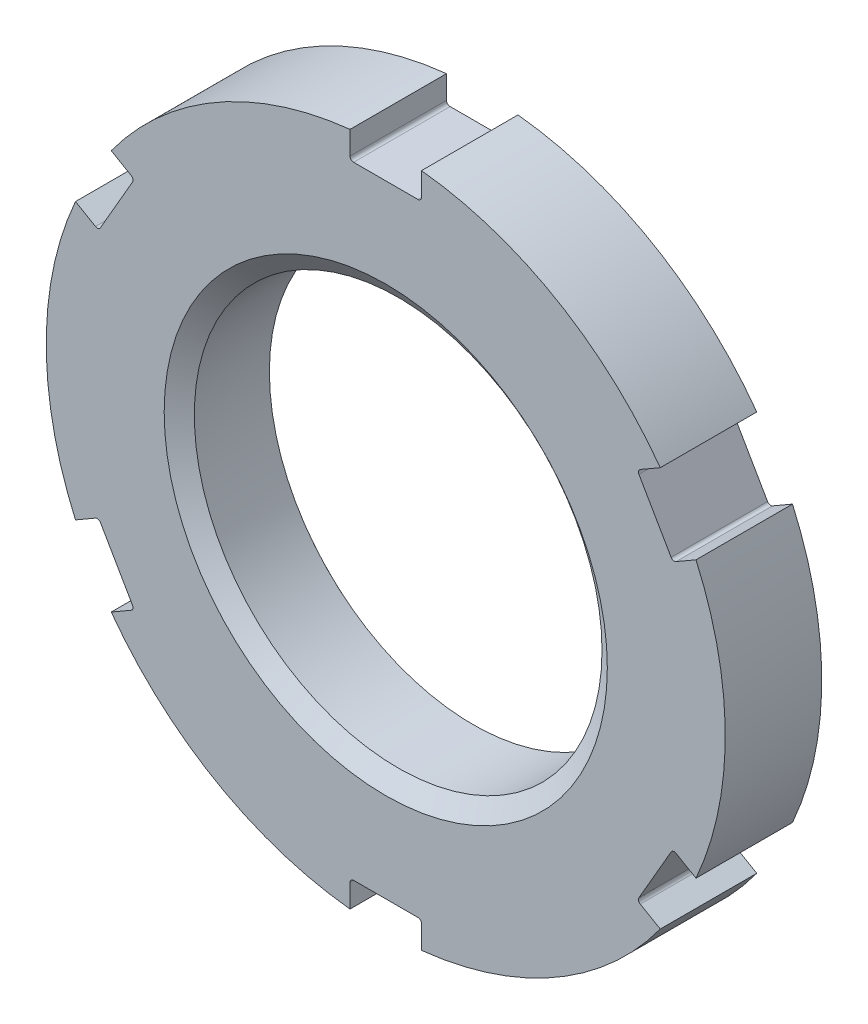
ISO-10303-21;
HEADER;
FILE_DESCRIPTION(('STEP AP214'),'2;1');
FILE_NAME('part.step','',(''),(''),'','','');
FILE_SCHEMA(('AUTOMOTIVE_DESIGN { 1 0 10303 214 1 1 1 1 }'));
ENDSEC;
DATA;
#1=APPLICATION_CONTEXT('core data for automotive mechanical design processes');
#2=APPLICATION_PROTOCOL_DEFINITION('international standard','automotive_design',2000,#1);
#3=PRODUCT_CONTEXT('',#1,'mechanical');
#4=PRODUCT('Part','Part','',(#3));
#5=PRODUCT_RELATED_PRODUCT_CATEGORY('part','',(#4));
#6=PRODUCT_DEFINITION_FORMATION('','',#4);
#7=PRODUCT_DEFINITION_CONTEXT('part definition',#1,'design');
#8=PRODUCT_DEFINITION('design','',#6,#7);
#9=PRODUCT_DEFINITION_SHAPE('','',#8);
#10=(LENGTH_UNIT() NAMED_UNIT(*) SI_UNIT(.MILLI.,.METRE.));
#11=(NAMED_UNIT(*) PLANE_ANGLE_UNIT() SI_UNIT($,.RADIAN.));
#12=(NAMED_UNIT(*) SI_UNIT($,.STERADIAN.) SOLID_ANGLE_UNIT());
#13=UNCERTAINTY_MEASURE_WITH_UNIT(LENGTH_MEASURE(1.E-05),#10,'distance_accuracy_value','');
#14=(GEOMETRIC_REPRESENTATION_CONTEXT(3) GLOBAL_UNCERTAINTY_ASSIGNED_CONTEXT((#13)) GLOBAL_UNIT_ASSIGNED_CONTEXT((#10,
#11,#12)) REPRESENTATION_CONTEXT('',''));
#15=CARTESIAN_POINT('',(0.,0.,0.));
#16=DIRECTION('',(0.,0.,1.));
#17=DIRECTION('',(1.,0.,0.));
#18=AXIS2_PLACEMENT_3D('',#15,#16,#17);
#19=CARTESIAN_POINT('',(0.,0.,-14.));
#20=DIRECTION('',(0.,0.,1.));
#21=DIRECTION('',(1.,0.,0.));
#22=AXIS2_PLACEMENT_3D('',#19,#20,#21);
#23=CYLINDRICAL_SURFACE('',#22,47.5);
#24=DIRECTION('',(0.,0.,1.));
#25=VECTOR('',#24,1.);
#26=CARTESIAN_POINT('',(38.4076704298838,27.9481815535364,-14.));
#27=LINE('',#26,#25);
#28=CARTESIAN_POINT('',(38.4076704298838,27.9481815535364,-13.5));
#29=VERTEX_POINT('',#28);
#30=CARTESIAN_POINT('',(38.4076704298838,27.9481815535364,0.));
#31=VERTEX_POINT('',#30);
#32=EDGE_CURVE('E282',#29,#31,#27,.T.);
#33=ORIENTED_EDGE('',*,*,#32,.F.);
#34=CARTESIAN_POINT('',(0.,0.,-13.5));
#35=DIRECTION('',(0.,0.,-1.));
#36=DIRECTION('',(-1.,0.,0.));
#37=AXIS2_PLACEMENT_3D('',#34,#35,#36);
#38=CIRCLE('',#37,47.5);
#39=CARTESIAN_POINT('',(4.99999999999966,47.236109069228,-13.5));
#40=VERTEX_POINT('',#39);
#41=EDGE_CURVE('E542',#29,#40,#38,.F.);
#42=ORIENTED_EDGE('',*,*,#41,.T.);
#43=DIRECTION('',(0.,0.,1.));
#44=VECTOR('',#43,1.);
#45=CARTESIAN_POINT('',(4.99999999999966,47.236109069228,-14.));
#46=LINE('',#45,#44);
#47=CARTESIAN_POINT('',(4.99999999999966,47.236109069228,0.));
#48=VERTEX_POINT('',#47);
#49=EDGE_CURVE('E379',#48,#40,#46,.F.);
#50=ORIENTED_EDGE('',*,*,#49,.F.);
#51=CARTESIAN_POINT('',(0.,0.,0.));
#52=DIRECTION('',(0.,0.,1.));
#53=DIRECTION('',(1.,0.,0.));
#54=AXIS2_PLACEMENT_3D('',#51,#52,#53);
#55=CIRCLE('',#54,47.5);
#56=EDGE_CURVE('E545',#31,#48,#55,.T.);
#57=ORIENTED_EDGE('',*,*,#56,.F.);
#58=EDGE_LOOP('',(#33,#42,#50,#57));
#59=FACE_BOUND('',#58,.T.);
#60=ADVANCED_FACE('F36',(#59),#23,.T.);
#61=DIRECTION('',(0.,0.,1.));
#62=VECTOR('',#61,1.);
#63=CARTESIAN_POINT('',(-5.00000000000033,47.2361090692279,-14.));
#64=LINE('',#63,#62);
#65=CARTESIAN_POINT('',(-5.00000000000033,47.2361090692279,-13.5));
#66=VERTEX_POINT('',#65);
#67=CARTESIAN_POINT('',(-5.00000000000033,47.2361090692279,0.));
#68=VERTEX_POINT('',#67);
#69=EDGE_CURVE('E377',#66,#68,#64,.T.);
#70=ORIENTED_EDGE('',*,*,#69,.F.);
#71=CARTESIAN_POINT('',(-38.4076704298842,27.9481815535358,-13.5));
#72=VERTEX_POINT('',#71);
#73=EDGE_CURVE('E575',#66,#72,#38,.F.);
#74=ORIENTED_EDGE('',*,*,#73,.T.);
#75=DIRECTION('',(0.,0.,1.));
#76=VECTOR('',#75,1.);
#77=CARTESIAN_POINT('',(-38.4076704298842,27.9481815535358,-14.));
#78=LINE('',#77,#76);
#79=CARTESIAN_POINT('',(-38.4076704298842,27.9481815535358,0.));
#80=VERTEX_POINT('',#79);
#81=EDGE_CURVE('E375',#80,#72,#78,.F.);
#82=ORIENTED_EDGE('',*,*,#81,.F.);
#83=EDGE_CURVE('E547',#68,#80,#55,.T.);
#84=ORIENTED_EDGE('',*,*,#83,.F.);
#85=EDGE_LOOP('',(#70,#74,#82,#84));
#86=FACE_BOUND('',#85,.T.);
#87=ADVANCED_FACE('F650',(#86),#23,.T.);
#88=DIRECTION('',(0.,0.,1.));
#89=VECTOR('',#88,1.);
#90=CARTESIAN_POINT('',(-43.4076704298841,19.2879275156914,-14.));
#91=LINE('',#90,#89);
#92=CARTESIAN_POINT('',(-43.4076704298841,19.2879275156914,-13.5));
#93=VERTEX_POINT('',#92);
#94=CARTESIAN_POINT('',(-43.4076704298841,19.2879275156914,0.));
#95=VERTEX_POINT('',#94);
#96=EDGE_CURVE('E373',#93,#95,#91,.T.);
#97=ORIENTED_EDGE('',*,*,#96,.F.);
#98=CARTESIAN_POINT('',(-43.4076704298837,-19.2879275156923,-13.5));
#99=VERTEX_POINT('',#98);
#100=EDGE_CURVE('E573',#93,#99,#38,.F.);
#101=ORIENTED_EDGE('',*,*,#100,.T.);
#102=DIRECTION('',(0.,0.,1.));
#103=VECTOR('',#102,1.);
#104=CARTESIAN_POINT('',(-43.4076704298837,-19.2879275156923,-14.));
#105=LINE('',#104,#103);
#106=CARTESIAN_POINT('',(-43.4076704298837,-19.2879275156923,0.));
#107=VERTEX_POINT('',#106);
#108=EDGE_CURVE('E371',#107,#99,#105,.F.);
#109=ORIENTED_EDGE('',*,*,#108,.F.);
#110=EDGE_CURVE('E550',#95,#107,#55,.T.);
#111=ORIENTED_EDGE('',*,*,#110,.F.);
#112=EDGE_LOOP('',(#97,#101,#109,#111));
#113=FACE_BOUND('',#112,.T.);
#114=ADVANCED_FACE('F654',(#113),#23,.T.);
#115=DIRECTION('',(0.,0.,1.));
#116=VECTOR('',#115,1.);
#117=CARTESIAN_POINT('',(-38.4076704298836,-27.9481815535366,-14.));
#118=LINE('',#117,#116);
#119=CARTESIAN_POINT('',(-38.4076704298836,-27.9481815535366,-13.5));
#120=VERTEX_POINT('',#119);
#121=CARTESIAN_POINT('',(-38.4076704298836,-27.9481815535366,0.));
#122=VERTEX_POINT('',#121);
#123=EDGE_CURVE('E302',#120,#122,#118,.T.);
#124=ORIENTED_EDGE('',*,*,#123,.F.);
#125=CARTESIAN_POINT('',(-4.99999999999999,-47.236109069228,-13.5));
#126=VERTEX_POINT('',#125);
#127=EDGE_CURVE('E442',#120,#126,#38,.F.);
#128=ORIENTED_EDGE('',*,*,#127,.T.);
#129=DIRECTION('',(0.,0.,1.));
#130=VECTOR('',#129,1.);
#131=CARTESIAN_POINT('',(-4.99999999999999,-47.236109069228,-14.));
#132=LINE('',#131,#130);
#133=CARTESIAN_POINT('',(-4.99999999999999,-47.236109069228,0.));
#134=VERTEX_POINT('',#133);
#135=EDGE_CURVE('E435',#134,#126,#132,.F.);
#136=ORIENTED_EDGE('',*,*,#135,.F.);
#137=EDGE_CURVE('E460',#122,#134,#55,.T.);
#138=ORIENTED_EDGE('',*,*,#137,.F.);
#139=EDGE_LOOP('',(#124,#128,#136,#138));
#140=FACE_BOUND('',#139,.T.);
#141=ADVANCED_FACE('F570',(#140),#23,.T.);
#142=DIRECTION('',(0.,0.,1.));
#143=VECTOR('',#142,1.);
#144=CARTESIAN_POINT('',(43.4076704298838,19.287927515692,-14.));
#145=LINE('',#144,#143);
#146=CARTESIAN_POINT('',(43.4076704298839,19.287927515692,0.));
#147=VERTEX_POINT('',#146);
#148=CARTESIAN_POINT('',(43.4076704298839,19.287927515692,-13.5));
#149=VERTEX_POINT('',#148);
#150=EDGE_CURVE('E382',#147,#149,#145,.F.);
#151=ORIENTED_EDGE('',*,*,#150,.F.);
#152=CARTESIAN_POINT('',(43.407670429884,-19.2879275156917,0.));
#153=VERTEX_POINT('',#152);
#154=EDGE_CURVE('E459',#153,#147,#55,.T.);
#155=ORIENTED_EDGE('',*,*,#154,.F.);
#156=DIRECTION('',(0.,0.,1.));
#157=VECTOR('',#156,1.);
#158=CARTESIAN_POINT('',(43.407670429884,-19.2879275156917,-14.));
#159=LINE('',#158,#157);
#160=CARTESIAN_POINT('',(43.407670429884,-19.2879275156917,-13.5));
#161=VERTEX_POINT('',#160);
#162=EDGE_CURVE('E401',#161,#153,#159,.T.);
#163=ORIENTED_EDGE('',*,*,#162,.F.);
#164=EDGE_CURVE('E469',#161,#149,#38,.F.);
#165=ORIENTED_EDGE('',*,*,#164,.T.);
#166=EDGE_LOOP('',(#151,#155,#163,#165));
#167=FACE_BOUND('',#166,.T.);
#168=ADVANCED_FACE('F590',(#167),#23,.T.);
#169=DIRECTION('',(0.,0.,1.));
#170=VECTOR('',#169,1.);
#171=CARTESIAN_POINT('',(38.407670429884,-27.9481815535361,-14.));
#172=LINE('',#171,#170);
#173=CARTESIAN_POINT('',(38.407670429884,-27.9481815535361,0.));
#174=VERTEX_POINT('',#173);
#175=CARTESIAN_POINT('',(38.407670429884,-27.9481815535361,-13.5));
#176=VERTEX_POINT('',#175);
#177=EDGE_CURVE('E408',#174,#176,#172,.F.);
#178=ORIENTED_EDGE('',*,*,#177,.F.);
#179=CARTESIAN_POINT('',(5.,-47.236109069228,0.));
#180=VERTEX_POINT('',#179);
#181=EDGE_CURVE('E455',#180,#174,#55,.T.);
#182=ORIENTED_EDGE('',*,*,#181,.F.);
#183=DIRECTION('',(0.,0.,1.));
#184=VECTOR('',#183,1.);
#185=CARTESIAN_POINT('',(5.,-47.236109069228,-14.));
#186=LINE('',#185,#184);
#187=CARTESIAN_POINT('',(5.,-47.236109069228,-13.5));
#188=VERTEX_POINT('',#187);
#189=EDGE_CURVE('E428',#188,#180,#186,.T.);
#190=ORIENTED_EDGE('',*,*,#189,.F.);
#191=EDGE_CURVE('E449',#188,#176,#38,.F.);
#192=ORIENTED_EDGE('',*,*,#191,.T.);
#193=EDGE_LOOP('',(#178,#182,#190,#192));
#194=FACE_BOUND('',#193,.T.);
#195=ADVANCED_FACE('F38',(#194),#23,.T.);
#196=CARTESIAN_POINT('',(0.,0.,-14.));
#197=DIRECTION('',(0.,0.,1.));
#198=DIRECTION('',(1.,0.,0.));
#199=AXIS2_PLACEMENT_3D('',#196,#197,#198);
#200=PLANE('',#199);
#201=CARTESIAN_POINT('',(0.,0.,-14.));
#202=DIRECTION('',(0.,0.,1.));
#203=DIRECTION('',(1.,0.,0.));
#204=AXIS2_PLACEMENT_3D('',#201,#202,#203);
#205=CIRCLE('',#204,31.);
#206=CARTESIAN_POINT('',(31.,0.,-14.));
#207=VERTEX_POINT('',#206);
#208=EDGE_CURVE('E448',#207,#207,#205,.F.);
#209=ORIENTED_EDGE('',*,*,#208,.F.);
#210=EDGE_LOOP('',(#209));
#211=FACE_BOUND('',#210,.T.);
#212=CARTESIAN_POINT('',(0.,0.,-14.));
#213=DIRECTION('',(0.,0.,-1.));
#214=DIRECTION('',(-1.,0.,0.));
#215=AXIS2_PLACEMENT_3D('',#212,#213,#214);
#216=CIRCLE('',#215,41.2749999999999);
#217=CARTESIAN_POINT('',(-41.2749999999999,0.,-14.));
#218=VERTEX_POINT('',#217);
#219=EDGE_CURVE('E438',#218,#218,#216,.T.);
#220=ORIENTED_EDGE('',*,*,#219,.T.);
#221=EDGE_LOOP('',(#220));
#222=FACE_BOUND('',#221,.T.);
#223=ADVANCED_FACE('F656',(#211,#222),#200,.F.);
#224=CARTESIAN_POINT('',(0.,0.,-14.));
#225=DIRECTION('',(0.,0.,1.));
#226=DIRECTION('',(1.,0.,0.));
#227=AXIS2_PLACEMENT_3D('',#224,#225,#226);
#228=CYLINDRICAL_SURFACE('',#227,28.52);
#229=CARTESIAN_POINT('',(0.,0.,-1.73651469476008));
#230=DIRECTION('',(0.,0.,1.));
#231=DIRECTION('',(1.,0.,0.));
#232=AXIS2_PLACEMENT_3D('',#229,#230,#231);
#233=CIRCLE('',#232,28.52);
#234=CARTESIAN_POINT('',(28.52,0.,-1.73651469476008));
#235=VERTEX_POINT('',#234);
#236=EDGE_CURVE('E453',#235,#235,#233,.F.);
#237=ORIENTED_EDGE('',*,*,#236,.F.);
#238=EDGE_LOOP('',(#237));
#239=FACE_BOUND('',#238,.T.);
#240=CARTESIAN_POINT('',(0.,0.,-12.2380853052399));
#241=DIRECTION('',(0.,0.,-1.));
#242=DIRECTION('',(-1.,0.,0.));
#243=AXIS2_PLACEMENT_3D('',#240,#241,#242);
#244=CIRCLE('',#243,28.52);
#245=CARTESIAN_POINT('',(-28.52,0.,-12.2380853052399));
#246=VERTEX_POINT('',#245);
#247=EDGE_CURVE('E454',#246,#246,#244,.F.);
#248=ORIENTED_EDGE('',*,*,#247,.F.);
#249=EDGE_LOOP('',(#248));
#250=FACE_BOUND('',#249,.T.);
#251=ADVANCED_FACE('F661',(#239,#250),#228,.F.);
#252=CARTESIAN_POINT('',(0.,0.,0.));
#253=DIRECTION('',(0.,0.,1.));
#254=DIRECTION('',(1.,0.,0.));
#255=AXIS2_PLACEMENT_3D('',#252,#253,#254);
#256=PLANE('',#255);
#257=DIRECTION('',(0.866025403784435,0.500000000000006,0.));
#258=VECTOR('',#257,1.);
#259=CARTESIAN_POINT('',(40.6051177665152,17.669872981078,0.));
#260=LINE('',#259,#258);
#261=CARTESIAN_POINT('',(40.6051177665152,17.669872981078,0.));
#262=VERTEX_POINT('',#261);
#263=EDGE_CURVE('E286',#262,#147,#260,.T.);
#264=ORIENTED_EDGE('',*,*,#263,.F.);
#265=CARTESIAN_POINT('',(40.3551177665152,18.1028856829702,0.));
#266=DIRECTION('',(0.,0.,1.));
#267=DIRECTION('',(0.500000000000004,-0.866025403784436,0.));
#268=AXIS2_PLACEMENT_3D('',#265,#266,#267);
#269=CIRCLE('',#268,0.5);
#270=CARTESIAN_POINT('',(39.922105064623,17.8528856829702,0.));
#271=VERTEX_POINT('',#270);
#272=EDGE_CURVE('E276',#271,#262,#269,.T.);
#273=ORIENTED_EDGE('',*,*,#272,.F.);
#274=DIRECTION('',(0.500000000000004,-0.866025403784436,0.));
#275=VECTOR('',#274,1.);
#276=CARTESIAN_POINT('',(35.422105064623,25.6471143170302,0.));
#277=LINE('',#276,#275);
#278=CARTESIAN_POINT('',(35.422105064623,25.6471143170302,0.));
#279=VERTEX_POINT('',#278);
#280=EDGE_CURVE('E293',#279,#271,#277,.T.);
#281=ORIENTED_EDGE('',*,*,#280,.F.);
#282=CARTESIAN_POINT('',(35.8551177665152,25.8971143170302,0.));
#283=DIRECTION('',(0.,0.,1.));
#284=DIRECTION('',(-0.500000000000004,0.866025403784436,0.));
#285=AXIS2_PLACEMENT_3D('',#282,#283,#284);
#286=CIRCLE('',#285,0.5);
#287=CARTESIAN_POINT('',(35.6051177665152,26.3301270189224,0.));
#288=VERTEX_POINT('',#287);
#289=EDGE_CURVE('E270',#288,#279,#286,.T.);
#290=ORIENTED_EDGE('',*,*,#289,.F.);
#291=DIRECTION('',(-0.866025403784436,-0.500000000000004,0.));
#292=VECTOR('',#291,1.);
#293=CARTESIAN_POINT('',(38.6362066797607,28.0801270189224,0.));
#294=LINE('',#293,#292);
#295=EDGE_CURVE('E279',#31,#288,#294,.T.);
#296=ORIENTED_EDGE('',*,*,#295,.F.);
#297=ORIENTED_EDGE('',*,*,#56,.T.);
#298=DIRECTION('',(0.,1.,0.));
#299=VECTOR('',#298,1.);
#300=CARTESIAN_POINT('',(4.99999999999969,44.,0.));
#301=LINE('',#300,#299);
#302=CARTESIAN_POINT('',(4.99999999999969,44.,0.));
#303=VERTEX_POINT('',#302);
#304=EDGE_CURVE('E306',#303,#48,#301,.T.);
#305=ORIENTED_EDGE('',*,*,#304,.F.);
#306=CARTESIAN_POINT('',(4.49999999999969,44.,0.));
#307=DIRECTION('',(0.,0.,1.));
#308=DIRECTION('',(1.,0.,0.));
#309=AXIS2_PLACEMENT_3D('',#306,#307,#308);
#310=CIRCLE('',#309,0.5);
#311=CARTESIAN_POINT('',(4.4999999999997,43.5,0.));
#312=VERTEX_POINT('',#311);
#313=EDGE_CURVE('E317',#312,#303,#310,.T.);
#314=ORIENTED_EDGE('',*,*,#313,.F.);
#315=DIRECTION('',(1.,0.,0.));
#316=VECTOR('',#315,1.);
#317=CARTESIAN_POINT('',(-4.5000000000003,43.5,0.));
#318=LINE('',#317,#316);
#319=CARTESIAN_POINT('',(-4.5000000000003,43.5,0.));
#320=VERTEX_POINT('',#319);
#321=EDGE_CURVE('E314',#320,#312,#318,.T.);
#322=ORIENTED_EDGE('',*,*,#321,.F.);
#323=CARTESIAN_POINT('',(-4.50000000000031,44.,0.));
#324=DIRECTION('',(0.,0.,1.));
#325=DIRECTION('',(-1.,0.,0.));
#326=AXIS2_PLACEMENT_3D('',#323,#324,#325);
#327=CIRCLE('',#326,0.5);
#328=CARTESIAN_POINT('',(-5.00000000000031,44.,0.));
#329=VERTEX_POINT('',#328);
#330=EDGE_CURVE('E311',#329,#320,#327,.T.);
#331=ORIENTED_EDGE('',*,*,#330,.F.);
#332=DIRECTION('',(0.,-1.,0.));
#333=VECTOR('',#332,1.);
#334=CARTESIAN_POINT('',(-5.00000000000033,47.5,0.));
#335=LINE('',#334,#333);
#336=EDGE_CURVE('E308',#68,#329,#335,.T.);
#337=ORIENTED_EDGE('',*,*,#336,.F.);
#338=ORIENTED_EDGE('',*,*,#83,.T.);
#339=DIRECTION('',(-0.866025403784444,0.49999999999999,0.));
#340=VECTOR('',#339,1.);
#341=CARTESIAN_POINT('',(-35.6051177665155,26.3301270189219,0.));
#342=LINE('',#341,#340);
#343=CARTESIAN_POINT('',(-35.6051177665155,26.3301270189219,0.));
#344=VERTEX_POINT('',#343);
#345=EDGE_CURVE('E327',#344,#80,#342,.T.);
#346=ORIENTED_EDGE('',*,*,#345,.F.);
#347=CARTESIAN_POINT('',(-35.8551177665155,25.8971143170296,0.));
#348=DIRECTION('',(0.,0.,1.));
#349=DIRECTION('',(0.499999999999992,0.866025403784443,0.));
#350=AXIS2_PLACEMENT_3D('',#347,#348,#349);
#351=CIRCLE('',#350,0.5);
#352=CARTESIAN_POINT('',(-35.4221050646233,25.6471143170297,0.));
#353=VERTEX_POINT('',#352);
#354=EDGE_CURVE('E339',#353,#344,#351,.T.);
#355=ORIENTED_EDGE('',*,*,#354,.F.);
#356=DIRECTION('',(0.499999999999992,0.866025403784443,0.));
#357=VECTOR('',#356,1.);
#358=CARTESIAN_POINT('',(-39.9221050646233,17.8528856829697,0.));
#359=LINE('',#358,#357);
#360=CARTESIAN_POINT('',(-39.9221050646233,17.8528856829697,0.));
#361=VERTEX_POINT('',#360);
#362=EDGE_CURVE('E336',#361,#353,#359,.T.);
#363=ORIENTED_EDGE('',*,*,#362,.F.);
#364=CARTESIAN_POINT('',(-40.3551177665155,18.1028856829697,0.));
#365=DIRECTION('',(0.,0.,1.));
#366=DIRECTION('',(-0.499999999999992,-0.866025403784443,0.));
#367=AXIS2_PLACEMENT_3D('',#364,#365,#366);
#368=CIRCLE('',#367,0.5);
#369=CARTESIAN_POINT('',(-40.6051177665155,17.6698729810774,0.));
#370=VERTEX_POINT('',#369);
#371=EDGE_CURVE('E333',#370,#361,#368,.T.);
#372=ORIENTED_EDGE('',*,*,#371,.F.);
#373=DIRECTION('',(0.866025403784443,-0.499999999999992,0.));
#374=VECTOR('',#373,1.);
#375=CARTESIAN_POINT('',(-43.636206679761,19.4198729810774,0.));
#376=LINE('',#375,#374);
#377=EDGE_CURVE('E329',#95,#370,#376,.T.);
#378=ORIENTED_EDGE('',*,*,#377,.F.);
#379=ORIENTED_EDGE('',*,*,#110,.T.);
#380=DIRECTION('',(-0.866025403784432,-0.500000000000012,0.));
#381=VECTOR('',#380,1.);
#382=CARTESIAN_POINT('',(-40.6051177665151,-17.6698729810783,0.));
#383=LINE('',#382,#381);
#384=CARTESIAN_POINT('',(-40.6051177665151,-17.6698729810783,0.));
#385=VERTEX_POINT('',#384);
#386=EDGE_CURVE('E349',#385,#107,#383,.T.);
#387=ORIENTED_EDGE('',*,*,#386,.F.);
#388=CARTESIAN_POINT('',(-40.3551177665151,-18.1028856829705,0.));
#389=DIRECTION('',(0.,0.,1.));
#390=DIRECTION('',(-0.50000000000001,0.866025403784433,0.));
#391=AXIS2_PLACEMENT_3D('',#388,#389,#390);
#392=CIRCLE('',#391,0.5);
#393=CARTESIAN_POINT('',(-39.9221050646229,-17.8528856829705,0.));
#394=VERTEX_POINT('',#393);
#395=EDGE_CURVE('E360',#394,#385,#392,.T.);
#396=ORIENTED_EDGE('',*,*,#395,.F.);
#397=DIRECTION('',(-0.50000000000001,0.866025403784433,0.));
#398=VECTOR('',#397,1.);
#399=CARTESIAN_POINT('',(-35.4221050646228,-25.6471143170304,0.));
#400=LINE('',#399,#398);
#401=CARTESIAN_POINT('',(-35.4221050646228,-25.6471143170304,0.));
#402=VERTEX_POINT('',#401);
#403=EDGE_CURVE('E357',#402,#394,#400,.T.);
#404=ORIENTED_EDGE('',*,*,#403,.F.);
#405=CARTESIAN_POINT('',(-35.855117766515,-25.8971143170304,0.));
#406=DIRECTION('',(0.,0.,1.));
#407=DIRECTION('',(0.50000000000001,-0.866025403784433,0.));
#408=AXIS2_PLACEMENT_3D('',#405,#406,#407);
#409=CIRCLE('',#408,0.5);
#410=CARTESIAN_POINT('',(-35.605117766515,-26.3301270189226,0.));
#411=VERTEX_POINT('',#410);
#412=EDGE_CURVE('E354',#411,#402,#409,.T.);
#413=ORIENTED_EDGE('',*,*,#412,.F.);
#414=DIRECTION('',(0.866025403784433,0.50000000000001,0.));
#415=VECTOR('',#414,1.);
#416=CARTESIAN_POINT('',(-38.6362066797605,-28.0801270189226,0.));
#417=LINE('',#416,#415);
#418=EDGE_CURVE('E351',#122,#411,#417,.T.);
#419=ORIENTED_EDGE('',*,*,#418,.F.);
#420=ORIENTED_EDGE('',*,*,#137,.T.);
#421=DIRECTION('',(0.,-1.,0.));
#422=VECTOR('',#421,1.);
#423=CARTESIAN_POINT('',(-5.,-44.,0.));
#424=LINE('',#423,#422);
#425=CARTESIAN_POINT('',(-5.,-44.,0.));
#426=VERTEX_POINT('',#425);
#427=EDGE_CURVE('E410',#426,#134,#424,.T.);
#428=ORIENTED_EDGE('',*,*,#427,.F.);
#429=CARTESIAN_POINT('',(-4.5,-44.,0.));
#430=DIRECTION('',(0.,0.,1.));
#431=DIRECTION('',(-1.,0.,0.));
#432=AXIS2_PLACEMENT_3D('',#429,#430,#431);
#433=CIRCLE('',#432,0.5);
#434=CARTESIAN_POINT('',(-4.5,-43.5,0.));
#435=VERTEX_POINT('',#434);
#436=EDGE_CURVE('E422',#435,#426,#433,.T.);
#437=ORIENTED_EDGE('',*,*,#436,.F.);
#438=DIRECTION('',(-1.,0.,0.));
#439=VECTOR('',#438,1.);
#440=CARTESIAN_POINT('',(4.5,-43.5,0.));
#441=LINE('',#440,#439);
#442=CARTESIAN_POINT('',(4.5,-43.5,0.));
#443=VERTEX_POINT('',#442);
#444=EDGE_CURVE('E419',#443,#435,#441,.T.);
#445=ORIENTED_EDGE('',*,*,#444,.F.);
#446=CARTESIAN_POINT('',(4.5,-44.,0.));
#447=DIRECTION('',(0.,0.,1.));
#448=DIRECTION('',(1.,0.,0.));
#449=AXIS2_PLACEMENT_3D('',#446,#447,#448);
#450=CIRCLE('',#449,0.5);
#451=CARTESIAN_POINT('',(5.,-44.,0.));
#452=VERTEX_POINT('',#451);
#453=EDGE_CURVE('E416',#452,#443,#450,.T.);
#454=ORIENTED_EDGE('',*,*,#453,.F.);
#455=DIRECTION('',(0.,1.,0.));
#456=VECTOR('',#455,1.);
#457=CARTESIAN_POINT('',(5.,-47.5,0.));
#458=LINE('',#457,#456);
#459=EDGE_CURVE('E413',#180,#452,#458,.T.);
#460=ORIENTED_EDGE('',*,*,#459,.F.);
#461=ORIENTED_EDGE('',*,*,#181,.T.);
#462=DIRECTION('',(0.866025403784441,-0.499999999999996,0.));
#463=VECTOR('',#462,1.);
#464=CARTESIAN_POINT('',(35.6051177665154,-26.3301270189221,0.));
#465=LINE('',#464,#463);
#466=CARTESIAN_POINT('',(35.6051177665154,-26.3301270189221,0.));
#467=VERTEX_POINT('',#466);
#468=EDGE_CURVE('E384',#467,#174,#465,.T.);
#469=ORIENTED_EDGE('',*,*,#468,.F.);
#470=CARTESIAN_POINT('',(35.8551177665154,-25.8971143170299,0.));
#471=DIRECTION('',(0.,0.,1.));
#472=DIRECTION('',(-0.499999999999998,-0.86602540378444,0.));
#473=AXIS2_PLACEMENT_3D('',#470,#471,#472);
#474=CIRCLE('',#473,0.5);
#475=CARTESIAN_POINT('',(35.4221050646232,-25.6471143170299,0.));
#476=VERTEX_POINT('',#475);
#477=EDGE_CURVE('E395',#476,#467,#474,.T.);
#478=ORIENTED_EDGE('',*,*,#477,.F.);
#479=DIRECTION('',(-0.499999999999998,-0.86602540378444,0.));
#480=VECTOR('',#479,1.);
#481=CARTESIAN_POINT('',(39.9221050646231,-17.8528856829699,0.));
#482=LINE('',#481,#480);
#483=CARTESIAN_POINT('',(39.9221050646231,-17.8528856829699,0.));
#484=VERTEX_POINT('',#483);
#485=EDGE_CURVE('E392',#484,#476,#482,.T.);
#486=ORIENTED_EDGE('',*,*,#485,.F.);
#487=CARTESIAN_POINT('',(40.3551177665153,-18.1028856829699,0.));
#488=DIRECTION('',(0.,0.,1.));
#489=DIRECTION('',(0.499999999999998,0.86602540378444,0.));
#490=AXIS2_PLACEMENT_3D('',#487,#488,#489);
#491=CIRCLE('',#490,0.5);
#492=CARTESIAN_POINT('',(40.6051177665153,-17.6698729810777,0.));
#493=VERTEX_POINT('',#492);
#494=EDGE_CURVE('E389',#493,#484,#491,.T.);
#495=ORIENTED_EDGE('',*,*,#494,.F.);
#496=DIRECTION('',(-0.86602540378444,0.499999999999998,0.));
#497=VECTOR('',#496,1.);
#498=CARTESIAN_POINT('',(43.6362066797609,-19.4198729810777,0.));
#499=LINE('',#498,#497);
#500=EDGE_CURVE('E386',#153,#493,#499,.T.);
#501=ORIENTED_EDGE('',*,*,#500,.F.);
#502=ORIENTED_EDGE('',*,*,#154,.T.);
#503=EDGE_LOOP('',(#264,#273,#281,#290,#296,#297,#305,#314,#322,#331,#337,#338,#346,#355,#363,
#372,#378,#379,#387,#396,#404,#413,#419,#420,#428,#437,#445,#454,#460,#461,#469,#478,#486,#495,
#501,#502));
#504=FACE_BOUND('',#503,.T.);
#505=CARTESIAN_POINT('',(0.,0.,0.));
#506=DIRECTION('',(0.,0.,1.));
#507=DIRECTION('',(1.,0.,0.));
#508=AXIS2_PLACEMENT_3D('',#505,#506,#507);
#509=CIRCLE('',#508,31.);
#510=CARTESIAN_POINT('',(31.,0.,0.));
#511=VERTEX_POINT('',#510);
#512=EDGE_CURVE('E450',#511,#511,#509,.T.);
#513=ORIENTED_EDGE('',*,*,#512,.F.);
#514=EDGE_LOOP('',(#513));
#515=FACE_BOUND('',#514,.T.);
#516=ADVANCED_FACE('F289',(#504,#515),#256,.T.);
#517=CARTESIAN_POINT('',(0.,0.,-1.91016616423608));
#518=DIRECTION('',(0.,0.,1.));
#519=DIRECTION('',(1.,0.,0.));
#520=AXIS2_PLACEMENT_3D('',#517,#518,#519);
#521=CONICAL_SURFACE('',#520,28.272,0.95993108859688);
#522=ORIENTED_EDGE('',*,*,#512,.T.);
#523=EDGE_LOOP('',(#522));
#524=FACE_BOUND('',#523,.T.);
#525=ORIENTED_EDGE('',*,*,#236,.T.);
#526=EDGE_LOOP('',(#525));
#527=FACE_BOUND('',#526,.T.);
#528=ADVANCED_FACE('F735',(#524,#527),#521,.F.);
#529=CARTESIAN_POINT('',(0.,0.,-13.9746));
#530=DIRECTION('',(0.,0.,-1.));
#531=DIRECTION('',(-1.,0.,0.));
#532=AXIS2_PLACEMENT_3D('',#529,#530,#531);
#533=CONICAL_SURFACE('',#532,31.,0.95993108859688);
#534=CARTESIAN_POINT('',(0.,0.,-13.9746));
#535=DIRECTION('',(0.,0.,1.));
#536=DIRECTION('',(1.,0.,0.));
#537=AXIS2_PLACEMENT_3D('',#534,#535,#536);
#538=CIRCLE('',#537,31.);
#539=CARTESIAN_POINT('',(31.,0.,-13.9746));
#540=VERTEX_POINT('',#539);
#541=EDGE_CURVE('E445',#540,#540,#538,.T.);
#542=ORIENTED_EDGE('',*,*,#541,.F.);
#543=EDGE_LOOP('',(#542));
#544=FACE_BOUND('',#543,.T.);
#545=ORIENTED_EDGE('',*,*,#247,.T.);
#546=EDGE_LOOP('',(#545));
#547=FACE_BOUND('',#546,.T.);
#548=ADVANCED_FACE('F732',(#544,#547),#533,.F.);
#549=CARTESIAN_POINT('',(0.,0.,-25.0375057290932));
#550=DIRECTION('',(0.,0.,1.));
#551=DIRECTION('',(1.,0.,0.));
#552=AXIS2_PLACEMENT_3D('',#549,#550,#551);
#553=CYLINDRICAL_SURFACE('',#552,31.);
#554=ORIENTED_EDGE('',*,*,#541,.T.);
#555=EDGE_LOOP('',(#554));
#556=FACE_BOUND('',#555,.T.);
#557=ORIENTED_EDGE('',*,*,#208,.T.);
#558=EDGE_LOOP('',(#557));
#559=FACE_BOUND('',#558,.T.);
#560=ADVANCED_FACE('F731',(#556,#559),#553,.F.);
#561=CARTESIAN_POINT('',(0.,0.,-13.5));
#562=DIRECTION('',(0.,0.,-1.));
#563=DIRECTION('',(-1.,0.,0.));
#564=AXIS2_PLACEMENT_3D('',#561,#562,#563);
#565=PLANE('',#564);
#566=DIRECTION('',(-0.866025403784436,-0.500000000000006,0.));
#567=VECTOR('',#566,1.);
#568=CARTESIAN_POINT('',(2.50000000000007,-4.33012701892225,-13.5));
#569=LINE('',#568,#567);
#570=CARTESIAN_POINT('',(40.6051177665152,17.669872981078,-13.5));
#571=VERTEX_POINT('',#570);
#572=EDGE_CURVE('E12',#149,#571,#569,.T.);
#573=ORIENTED_EDGE('',*,*,#572,.F.);
#574=ORIENTED_EDGE('',*,*,#164,.F.);
#575=DIRECTION('',(0.86602540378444,-0.499999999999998,0.));
#576=VECTOR('',#575,1.);
#577=CARTESIAN_POINT('',(2.49999999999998,4.33012701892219,-13.5));
#578=LINE('',#577,#576);
#579=CARTESIAN_POINT('',(40.6051177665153,-17.6698729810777,-13.5));
#580=VERTEX_POINT('',#579);
#581=EDGE_CURVE('E480',#580,#161,#578,.T.);
#582=ORIENTED_EDGE('',*,*,#581,.F.);
#583=CARTESIAN_POINT('',(40.3551177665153,-18.1028856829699,-13.5));
#584=DIRECTION('',(0.,0.,-1.));
#585=DIRECTION('',(-1.,0.,0.));
#586=AXIS2_PLACEMENT_3D('',#583,#584,#585);
#587=CIRCLE('',#586,0.5);
#588=CARTESIAN_POINT('',(39.9221050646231,-17.8528856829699,-13.5));
#589=VERTEX_POINT('',#588);
#590=EDGE_CURVE('E482',#589,#580,#587,.T.);
#591=ORIENTED_EDGE('',*,*,#590,.F.);
#592=DIRECTION('',(0.499999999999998,0.86602540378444,0.));
#593=VECTOR('',#592,1.);
#594=CARTESIAN_POINT('',(37.6721050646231,-21.7499999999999,-13.5));
#595=LINE('',#594,#593);
#596=CARTESIAN_POINT('',(35.4221050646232,-25.6471143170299,-13.5));
#597=VERTEX_POINT('',#596);
#598=EDGE_CURVE('E485',#597,#589,#595,.T.);
#599=ORIENTED_EDGE('',*,*,#598,.F.);
#600=CARTESIAN_POINT('',(35.8551177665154,-25.8971143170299,-13.5));
#601=DIRECTION('',(0.,0.,-1.));
#602=DIRECTION('',(-1.,0.,0.));
#603=AXIS2_PLACEMENT_3D('',#600,#601,#602);
#604=CIRCLE('',#603,0.5);
#605=CARTESIAN_POINT('',(35.6051177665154,-26.3301270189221,-13.5));
#606=VERTEX_POINT('',#605);
#607=EDGE_CURVE('E487',#606,#597,#604,.T.);
#608=ORIENTED_EDGE('',*,*,#607,.F.);
#609=DIRECTION('',(-0.866025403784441,0.499999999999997,0.));
#610=VECTOR('',#609,1.);
#611=CARTESIAN_POINT('',(-2.50000000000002,-4.33012701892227,-13.5));
#612=LINE('',#611,#610);
#613=EDGE_CURVE('E489',#176,#606,#612,.T.);
#614=ORIENTED_EDGE('',*,*,#613,.F.);
#615=ORIENTED_EDGE('',*,*,#191,.F.);
#616=DIRECTION('',(0.,-1.,0.));
#617=VECTOR('',#616,1.);
#618=CARTESIAN_POINT('',(4.99999999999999,0.,-13.5));
#619=LINE('',#618,#617);
#620=CARTESIAN_POINT('',(5.,-44.,-13.5));
#621=VERTEX_POINT('',#620);
#622=EDGE_CURVE('E458',#621,#188,#619,.T.);
#623=ORIENTED_EDGE('',*,*,#622,.F.);
#624=CARTESIAN_POINT('',(4.5,-44.,-13.5));
#625=DIRECTION('',(0.,0.,-1.));
#626=DIRECTION('',(-1.,0.,0.));
#627=AXIS2_PLACEMENT_3D('',#624,#625,#626);
#628=CIRCLE('',#627,0.5);
#629=CARTESIAN_POINT('',(4.5,-43.5,-13.5));
#630=VERTEX_POINT('',#629);
#631=EDGE_CURVE('E471',#630,#621,#628,.T.);
#632=ORIENTED_EDGE('',*,*,#631,.F.);
#633=DIRECTION('',(1.,0.,0.));
#634=VECTOR('',#633,1.);
#635=CARTESIAN_POINT('',(0.,-43.5,-13.5));
#636=LINE('',#635,#634);
#637=CARTESIAN_POINT('',(-4.5,-43.5,-13.5));
#638=VERTEX_POINT('',#637);
#639=EDGE_CURVE('E474',#638,#630,#636,.T.);
#640=ORIENTED_EDGE('',*,*,#639,.F.);
#641=CARTESIAN_POINT('',(-4.5,-44.,-13.5));
#642=DIRECTION('',(0.,0.,-1.));
#643=DIRECTION('',(-1.,0.,0.));
#644=AXIS2_PLACEMENT_3D('',#641,#642,#643);
#645=CIRCLE('',#644,0.5);
#646=CARTESIAN_POINT('',(-5.,-44.,-13.5));
#647=VERTEX_POINT('',#646);
#648=EDGE_CURVE('E476',#647,#638,#645,.T.);
#649=ORIENTED_EDGE('',*,*,#648,.F.);
#650=DIRECTION('',(0.,1.,0.));
#651=VECTOR('',#650,1.);
#652=CARTESIAN_POINT('',(-5.00000000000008,0.,-13.5));
#653=LINE('',#652,#651);
#654=EDGE_CURVE('E478',#126,#647,#653,.T.);
#655=ORIENTED_EDGE('',*,*,#654,.F.);
#656=ORIENTED_EDGE('',*,*,#127,.F.);
#657=DIRECTION('',(-0.866025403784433,-0.50000000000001,0.));
#658=VECTOR('',#657,1.);
#659=CARTESIAN_POINT('',(2.50000000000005,-4.33012701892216,-13.5));
#660=LINE('',#659,#658);
#661=CARTESIAN_POINT('',(-35.605117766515,-26.3301270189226,-13.5));
#662=VERTEX_POINT('',#661);
#663=EDGE_CURVE('E491',#662,#120,#660,.T.);
#664=ORIENTED_EDGE('',*,*,#663,.F.);
#665=CARTESIAN_POINT('',(-35.855117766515,-25.8971143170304,-13.5));
#666=DIRECTION('',(0.,0.,-1.));
#667=DIRECTION('',(-1.,0.,0.));
#668=AXIS2_PLACEMENT_3D('',#665,#666,#667);
#669=CIRCLE('',#668,0.5);
#670=CARTESIAN_POINT('',(-35.4221050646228,-25.6471143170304,-13.5));
#671=VERTEX_POINT('',#670);
#672=EDGE_CURVE('E493',#671,#662,#669,.T.);
#673=ORIENTED_EDGE('',*,*,#672,.F.);
#674=DIRECTION('',(0.50000000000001,-0.866025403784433,0.));
#675=VECTOR('',#674,1.);
#676=CARTESIAN_POINT('',(-37.6721050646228,-21.7500000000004,-13.5));
#677=LINE('',#676,#675);
#678=CARTESIAN_POINT('',(-39.9221050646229,-17.8528856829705,-13.5));
#679=VERTEX_POINT('',#678);
#680=EDGE_CURVE('E496',#679,#671,#677,.T.);
#681=ORIENTED_EDGE('',*,*,#680,.F.);
#682=CARTESIAN_POINT('',(-40.3551177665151,-18.1028856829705,-13.5));
#683=DIRECTION('',(0.,0.,-1.));
#684=DIRECTION('',(-1.,0.,0.));
#685=AXIS2_PLACEMENT_3D('',#682,#683,#684);
#686=CIRCLE('',#685,0.5);
#687=CARTESIAN_POINT('',(-40.6051177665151,-17.6698729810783,-13.5));
#688=VERTEX_POINT('',#687);
#689=EDGE_CURVE('E498',#688,#679,#686,.T.);
#690=ORIENTED_EDGE('',*,*,#689,.F.);
#691=DIRECTION('',(0.866025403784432,0.500000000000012,0.));
#692=VECTOR('',#691,1.);
#693=CARTESIAN_POINT('',(-2.5000000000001,4.33012701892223,-13.5));
#694=LINE('',#693,#692);
#695=EDGE_CURVE('E500',#99,#688,#694,.T.);
#696=ORIENTED_EDGE('',*,*,#695,.F.);
#697=ORIENTED_EDGE('',*,*,#100,.F.);
#698=DIRECTION('',(-0.866025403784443,0.499999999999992,0.));
#699=VECTOR('',#698,1.);
#700=CARTESIAN_POINT('',(-2.49999999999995,-4.33012701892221,-13.5));
#701=LINE('',#700,#699);
#702=CARTESIAN_POINT('',(-40.6051177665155,17.6698729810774,-13.5));
#703=VERTEX_POINT('',#702);
#704=EDGE_CURVE('E502',#703,#93,#701,.T.);
#705=ORIENTED_EDGE('',*,*,#704,.F.);
#706=CARTESIAN_POINT('',(-40.3551177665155,18.1028856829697,-13.5));
#707=DIRECTION('',(0.,0.,-1.));
#708=DIRECTION('',(-1.,0.,0.));
#709=AXIS2_PLACEMENT_3D('',#706,#707,#708);
#710=CIRCLE('',#709,0.5);
#711=CARTESIAN_POINT('',(-39.9221050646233,17.8528856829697,-13.5));
#712=VERTEX_POINT('',#711);
#713=EDGE_CURVE('E504',#712,#703,#710,.T.);
#714=ORIENTED_EDGE('',*,*,#713,.F.);
#715=DIRECTION('',(-0.499999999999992,-0.866025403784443,0.));
#716=VECTOR('',#715,1.);
#717=CARTESIAN_POINT('',(-37.6721050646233,21.7499999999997,-13.5));
#718=LINE('',#717,#716);
#719=CARTESIAN_POINT('',(-35.4221050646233,25.6471143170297,-13.5));
#720=VERTEX_POINT('',#719);
#721=EDGE_CURVE('E507',#720,#712,#718,.T.);
#722=ORIENTED_EDGE('',*,*,#721,.F.);
#723=CARTESIAN_POINT('',(-35.8551177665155,25.8971143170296,-13.5));
#724=DIRECTION('',(0.,0.,-1.));
#725=DIRECTION('',(-1.,0.,0.));
#726=AXIS2_PLACEMENT_3D('',#723,#724,#725);
#727=CIRCLE('',#726,0.5);
#728=CARTESIAN_POINT('',(-35.6051177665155,26.3301270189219,-13.5));
#729=VERTEX_POINT('',#728);
#730=EDGE_CURVE('E509',#729,#720,#727,.T.);
#731=ORIENTED_EDGE('',*,*,#730,.F.);
#732=DIRECTION('',(0.866025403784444,-0.499999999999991,0.));
#733=VECTOR('',#732,1.);
#734=CARTESIAN_POINT('',(2.49999999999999,4.33012701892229,-13.5));
#735=LINE('',#734,#733);
#736=EDGE_CURVE('E511',#72,#729,#735,.T.);
#737=ORIENTED_EDGE('',*,*,#736,.F.);
#738=ORIENTED_EDGE('',*,*,#73,.F.);
#739=DIRECTION('',(0.,1.,0.));
#740=VECTOR('',#739,1.);
#741=CARTESIAN_POINT('',(-4.99999999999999,0.,-13.5));
#742=LINE('',#741,#740);
#743=CARTESIAN_POINT('',(-5.00000000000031,44.,-13.5));
#744=VERTEX_POINT('',#743);
#745=EDGE_CURVE('E513',#744,#66,#742,.T.);
#746=ORIENTED_EDGE('',*,*,#745,.F.);
#747=CARTESIAN_POINT('',(-4.50000000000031,44.,-13.5));
#748=DIRECTION('',(0.,0.,-1.));
#749=DIRECTION('',(-1.,0.,0.));
#750=AXIS2_PLACEMENT_3D('',#747,#748,#749);
#751=CIRCLE('',#750,0.5);
#752=CARTESIAN_POINT('',(-4.5000000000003,43.5,-13.5));
#753=VERTEX_POINT('',#752);
#754=EDGE_CURVE('E515',#753,#744,#751,.T.);
#755=ORIENTED_EDGE('',*,*,#754,.F.);
#756=DIRECTION('',(-1.,0.,0.));
#757=VECTOR('',#756,1.);
#758=CARTESIAN_POINT('',(-3.03758876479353E-13,43.5,-13.5));
#759=LINE('',#758,#757);
#760=CARTESIAN_POINT('',(4.4999999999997,43.5,-13.5));
#761=VERTEX_POINT('',#760);
#762=EDGE_CURVE('E517',#761,#753,#759,.T.);
#763=ORIENTED_EDGE('',*,*,#762,.F.);
#764=CARTESIAN_POINT('',(4.49999999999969,44.,-13.5));
#765=DIRECTION('',(0.,0.,-1.));
#766=DIRECTION('',(-1.,0.,0.));
#767=AXIS2_PLACEMENT_3D('',#764,#765,#766);
#768=CIRCLE('',#767,0.5);
#769=CARTESIAN_POINT('',(4.99999999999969,44.,-13.5));
#770=VERTEX_POINT('',#769);
#771=EDGE_CURVE('E519',#770,#761,#768,.T.);
#772=ORIENTED_EDGE('',*,*,#771,.F.);
#773=DIRECTION('',(0.,-1.,0.));
#774=VECTOR('',#773,1.);
#775=CARTESIAN_POINT('',(5.00000000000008,0.,-13.5));
#776=LINE('',#775,#774);
#777=EDGE_CURVE('E521',#40,#770,#776,.T.);
#778=ORIENTED_EDGE('',*,*,#777,.F.);
#779=ORIENTED_EDGE('',*,*,#41,.F.);
#780=DIRECTION('',(0.866025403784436,0.500000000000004,0.));
#781=VECTOR('',#780,1.);
#782=CARTESIAN_POINT('',(-2.50000000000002,4.33012701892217,-13.5));
#783=LINE('',#782,#781);
#784=CARTESIAN_POINT('',(35.6051177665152,26.3301270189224,-13.5));
#785=VERTEX_POINT('',#784);
#786=EDGE_CURVE('E523',#785,#29,#783,.T.);
#787=ORIENTED_EDGE('',*,*,#786,.F.);
#788=CARTESIAN_POINT('',(35.8551177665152,25.8971143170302,-13.5));
#789=DIRECTION('',(0.,0.,-1.));
#790=DIRECTION('',(-1.,0.,0.));
#791=AXIS2_PLACEMENT_3D('',#788,#789,#790);
#792=CIRCLE('',#791,0.5);
#793=CARTESIAN_POINT('',(35.422105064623,25.6471143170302,-13.5));
#794=VERTEX_POINT('',#793);
#795=EDGE_CURVE('E273',#794,#785,#792,.T.);
#796=ORIENTED_EDGE('',*,*,#795,.F.);
#797=DIRECTION('',(-0.500000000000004,0.866025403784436,0.));
#798=VECTOR('',#797,1.);
#799=CARTESIAN_POINT('',(37.672105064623,21.7500000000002,-13.5));
#800=LINE('',#799,#798);
#801=CARTESIAN_POINT('',(39.922105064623,17.8528856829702,-13.5));
#802=VERTEX_POINT('',#801);
#803=EDGE_CURVE('E526',#802,#794,#800,.T.);
#804=ORIENTED_EDGE('',*,*,#803,.F.);
#805=CARTESIAN_POINT('',(40.3551177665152,18.1028856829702,-13.5));
#806=DIRECTION('',(0.,0.,-1.));
#807=DIRECTION('',(-1.,0.,0.));
#808=AXIS2_PLACEMENT_3D('',#805,#806,#807);
#809=CIRCLE('',#808,0.5);
#810=EDGE_CURVE('E44',#571,#802,#809,.T.);
#811=ORIENTED_EDGE('',*,*,#810,.F.);
#812=EDGE_LOOP('',(#573,#574,#582,#591,#599,#608,#614,#615,#623,#632,#640,#649,#655,#656,#664,
#673,#681,#690,#696,#697,#705,#714,#722,#731,#737,#738,#746,#755,#763,#772,#778,#779,#787,#796,
#804,#811));
#813=FACE_BOUND('',#812,.T.);
#814=CARTESIAN_POINT('',(0.,0.,-13.5));
#815=DIRECTION('',(0.,0.,-1.));
#816=DIRECTION('',(-1.,0.,0.));
#817=AXIS2_PLACEMENT_3D('',#814,#815,#816);
#818=CIRCLE('',#817,41.2749999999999);
#819=CARTESIAN_POINT('',(-41.2749999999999,0.,-13.5));
#820=VERTEX_POINT('',#819);
#821=EDGE_CURVE('E439',#820,#820,#818,.T.);
#822=ORIENTED_EDGE('',*,*,#821,.F.);
#823=EDGE_LOOP('',(#822));
#824=FACE_BOUND('',#823,.T.);
#825=ADVANCED_FACE('F537',(#813,#824),#565,.T.);
#826=CARTESIAN_POINT('',(0.,0.,-13.5));
#827=DIRECTION('',(0.,0.,-1.));
#828=DIRECTION('',(-1.,0.,0.));
#829=AXIS2_PLACEMENT_3D('',#826,#827,#828);
#830=CYLINDRICAL_SURFACE('',#829,41.2749999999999);
#831=ORIENTED_EDGE('',*,*,#821,.T.);
#832=EDGE_LOOP('',(#831));
#833=FACE_BOUND('',#832,.T.);
#834=ORIENTED_EDGE('',*,*,#219,.F.);
#835=EDGE_LOOP('',(#834));
#836=FACE_BOUND('',#835,.T.);
#837=ADVANCED_FACE('F646',(#833,#836),#830,.T.);
#838=CARTESIAN_POINT('',(-5.,-44.,-14.));
#839=DIRECTION('',(-1.,0.,0.));
#840=DIRECTION('',(0.,-1.,0.));
#841=AXIS2_PLACEMENT_3D('',#838,#839,#840);
#842=PLANE('',#841);
#843=ORIENTED_EDGE('',*,*,#135,.T.);
#844=ORIENTED_EDGE('',*,*,#654,.T.);
#845=DIRECTION('',(0.,0.,1.));
#846=VECTOR('',#845,1.);
#847=CARTESIAN_POINT('',(-5.,-44.,-14.));
#848=LINE('',#847,#846);
#849=EDGE_CURVE('E426',#647,#426,#848,.T.);
#850=ORIENTED_EDGE('',*,*,#849,.T.);
#851=ORIENTED_EDGE('',*,*,#427,.T.);
#852=EDGE_LOOP('',(#843,#844,#850,#851));
#853=FACE_BOUND('',#852,.T.);
#854=ADVANCED_FACE('F567',(#853),#842,.F.);
#855=CARTESIAN_POINT('',(-4.5,-44.,-14.));
#856=DIRECTION('',(0.,0.,1.));
#857=DIRECTION('',(1.,0.,0.));
#858=AXIS2_PLACEMENT_3D('',#855,#856,#857);
#859=CYLINDRICAL_SURFACE('',#858,0.5);
#860=ORIENTED_EDGE('',*,*,#648,.T.);
#861=DIRECTION('',(0.,0.,1.));
#862=VECTOR('',#861,1.);
#863=CARTESIAN_POINT('',(-4.5,-43.5,-14.));
#864=LINE('',#863,#862);
#865=EDGE_CURVE('E429',#638,#435,#864,.T.);
#866=ORIENTED_EDGE('',*,*,#865,.T.);
#867=ORIENTED_EDGE('',*,*,#436,.T.);
#868=ORIENTED_EDGE('',*,*,#849,.F.);
#869=EDGE_LOOP('',(#860,#866,#867,#868));
#870=FACE_BOUND('',#869,.T.);
#871=ADVANCED_FACE('F638',(#870),#859,.F.);
#872=CARTESIAN_POINT('',(4.5,-43.5,-14.));
#873=DIRECTION('',(0.,1.,0.));
#874=DIRECTION('',(0.,0.,1.));
#875=AXIS2_PLACEMENT_3D('',#872,#873,#874);
#876=PLANE('',#875);
#877=ORIENTED_EDGE('',*,*,#639,.T.);
#878=DIRECTION('',(0.,0.,1.));
#879=VECTOR('',#878,1.);
#880=CARTESIAN_POINT('',(4.5,-43.5,-14.));
#881=LINE('',#880,#879);
#882=EDGE_CURVE('E431',#630,#443,#881,.T.);
#883=ORIENTED_EDGE('',*,*,#882,.T.);
#884=ORIENTED_EDGE('',*,*,#444,.T.);
#885=ORIENTED_EDGE('',*,*,#865,.F.);
#886=EDGE_LOOP('',(#877,#883,#884,#885));
#887=FACE_BOUND('',#886,.T.);
#888=ADVANCED_FACE('F636',(#887),#876,.F.);
#889=CARTESIAN_POINT('',(4.5,-44.,-14.));
#890=DIRECTION('',(0.,0.,1.));
#891=DIRECTION('',(1.,0.,0.));
#892=AXIS2_PLACEMENT_3D('',#889,#890,#891);
#893=CYLINDRICAL_SURFACE('',#892,0.5);
#894=ORIENTED_EDGE('',*,*,#631,.T.);
#895=DIRECTION('',(0.,0.,1.));
#896=VECTOR('',#895,1.);
#897=CARTESIAN_POINT('',(5.,-44.,-14.));
#898=LINE('',#897,#896);
#899=EDGE_CURVE('E425',#621,#452,#898,.T.);
#900=ORIENTED_EDGE('',*,*,#899,.T.);
#901=ORIENTED_EDGE('',*,*,#453,.T.);
#902=ORIENTED_EDGE('',*,*,#882,.F.);
#903=EDGE_LOOP('',(#894,#900,#901,#902));
#904=FACE_BOUND('',#903,.T.);
#905=ADVANCED_FACE('F630',(#904),#893,.F.);
#906=CARTESIAN_POINT('',(5.,-47.5,-14.));
#907=DIRECTION('',(1.,0.,0.));
#908=DIRECTION('',(0.,1.,0.));
#909=AXIS2_PLACEMENT_3D('',#906,#907,#908);
#910=PLANE('',#909);
#911=ORIENTED_EDGE('',*,*,#189,.T.);
#912=ORIENTED_EDGE('',*,*,#459,.T.);
#913=ORIENTED_EDGE('',*,*,#899,.F.);
#914=ORIENTED_EDGE('',*,*,#622,.T.);
#915=EDGE_LOOP('',(#911,#912,#913,#914));
#916=FACE_BOUND('',#915,.T.);
#917=ADVANCED_FACE('F625',(#916),#910,.F.);
#918=CARTESIAN_POINT('',(35.6051177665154,-26.3301270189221,-14.));
#919=DIRECTION('',(-0.499999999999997,-0.866025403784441,0.));
#920=DIRECTION('',(0.866025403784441,-0.499999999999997,0.));
#921=AXIS2_PLACEMENT_3D('',#918,#919,#920);
#922=PLANE('',#921);
#923=ORIENTED_EDGE('',*,*,#177,.T.);
#924=ORIENTED_EDGE('',*,*,#613,.T.);
#925=DIRECTION('',(0.,0.,1.));
#926=VECTOR('',#925,1.);
#927=CARTESIAN_POINT('',(35.6051177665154,-26.3301270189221,-14.));
#928=LINE('',#927,#926);
#929=EDGE_CURVE('E399',#606,#467,#928,.T.);
#930=ORIENTED_EDGE('',*,*,#929,.T.);
#931=ORIENTED_EDGE('',*,*,#468,.T.);
#932=EDGE_LOOP('',(#923,#924,#930,#931));
#933=FACE_BOUND('',#932,.T.);
#934=ADVANCED_FACE('F616',(#933),#922,.F.);
#935=CARTESIAN_POINT('',(35.8551177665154,-25.8971143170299,-14.));
#936=DIRECTION('',(0.,0.,1.));
#937=DIRECTION('',(1.,0.,0.));
#938=AXIS2_PLACEMENT_3D('',#935,#936,#937);
#939=CYLINDRICAL_SURFACE('',#938,0.5);
#940=ORIENTED_EDGE('',*,*,#607,.T.);
#941=DIRECTION('',(0.,0.,1.));
#942=VECTOR('',#941,1.);
#943=CARTESIAN_POINT('',(35.4221050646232,-25.6471143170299,-14.));
#944=LINE('',#943,#942);
#945=EDGE_CURVE('E402',#597,#476,#944,.T.);
#946=ORIENTED_EDGE('',*,*,#945,.T.);
#947=ORIENTED_EDGE('',*,*,#477,.T.);
#948=ORIENTED_EDGE('',*,*,#929,.F.);
#949=EDGE_LOOP('',(#940,#946,#947,#948));
#950=FACE_BOUND('',#949,.T.);
#951=ADVANCED_FACE('F612',(#950),#939,.F.);
#952=CARTESIAN_POINT('',(39.9221050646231,-17.8528856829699,-14.));
#953=DIRECTION('',(-0.86602540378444,0.499999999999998,0.));
#954=DIRECTION('',(-0.499999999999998,-0.86602540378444,0.));
#955=AXIS2_PLACEMENT_3D('',#952,#953,#954);
#956=PLANE('',#955);
#957=ORIENTED_EDGE('',*,*,#598,.T.);
#958=DIRECTION('',(0.,0.,1.));
#959=VECTOR('',#958,1.);
#960=CARTESIAN_POINT('',(39.9221050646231,-17.8528856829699,-14.));
#961=LINE('',#960,#959);
#962=EDGE_CURVE('E404',#589,#484,#961,.T.);
#963=ORIENTED_EDGE('',*,*,#962,.T.);
#964=ORIENTED_EDGE('',*,*,#485,.T.);
#965=ORIENTED_EDGE('',*,*,#945,.F.);
#966=EDGE_LOOP('',(#957,#963,#964,#965));
#967=FACE_BOUND('',#966,.T.);
#968=ADVANCED_FACE('F609',(#967),#956,.F.);
#969=CARTESIAN_POINT('',(40.3551177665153,-18.1028856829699,-14.));
#970=DIRECTION('',(0.,0.,1.));
#971=DIRECTION('',(1.,0.,0.));
#972=AXIS2_PLACEMENT_3D('',#969,#970,#971);
#973=CYLINDRICAL_SURFACE('',#972,0.5);
#974=ORIENTED_EDGE('',*,*,#590,.T.);
#975=DIRECTION('',(0.,0.,1.));
#976=VECTOR('',#975,1.);
#977=CARTESIAN_POINT('',(40.6051177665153,-17.6698729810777,-14.));
#978=LINE('',#977,#976);
#979=EDGE_CURVE('E398',#580,#493,#978,.T.);
#980=ORIENTED_EDGE('',*,*,#979,.T.);
#981=ORIENTED_EDGE('',*,*,#494,.T.);
#982=ORIENTED_EDGE('',*,*,#962,.F.);
#983=EDGE_LOOP('',(#974,#980,#981,#982));
#984=FACE_BOUND('',#983,.T.);
#985=ADVANCED_FACE('F603',(#984),#973,.F.);
#986=CARTESIAN_POINT('',(43.6362066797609,-19.4198729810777,-14.));
#987=DIRECTION('',(0.499999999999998,0.86602540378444,0.));
#988=DIRECTION('',(-0.86602540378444,0.499999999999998,0.));
#989=AXIS2_PLACEMENT_3D('',#986,#987,#988);
#990=PLANE('',#989);
#991=ORIENTED_EDGE('',*,*,#162,.T.);
#992=ORIENTED_EDGE('',*,*,#500,.T.);
#993=ORIENTED_EDGE('',*,*,#979,.F.);
#994=ORIENTED_EDGE('',*,*,#581,.T.);
#995=EDGE_LOOP('',(#991,#992,#993,#994));
#996=FACE_BOUND('',#995,.T.);
#997=ADVANCED_FACE('F600',(#996),#990,.F.);
#998=CARTESIAN_POINT('',(-40.6051177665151,-17.6698729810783,-14.));
#999=DIRECTION('',(-0.500000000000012,0.866025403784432,0.));
#1000=DIRECTION('',(-0.866025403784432,-0.500000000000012,0.));
#1001=AXIS2_PLACEMENT_3D('',#998,#999,#1000);
#1002=PLANE('',#1001);
#1003=ORIENTED_EDGE('',*,*,#108,.T.);
#1004=ORIENTED_EDGE('',*,*,#695,.T.);
#1005=DIRECTION('',(0.,0.,1.));
#1006=VECTOR('',#1005,1.);
#1007=CARTESIAN_POINT('',(-40.6051177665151,-17.6698729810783,-14.));
#1008=LINE('',#1007,#1006);
#1009=EDGE_CURVE('E330',#688,#385,#1008,.T.);
#1010=ORIENTED_EDGE('',*,*,#1009,.T.);
#1011=ORIENTED_EDGE('',*,*,#386,.T.);
#1012=EDGE_LOOP('',(#1003,#1004,#1010,#1011));
#1013=FACE_BOUND('',#1012,.T.);
#1014=ADVANCED_FACE('F680',(#1013),#1002,.F.);
#1015=CARTESIAN_POINT('',(-40.3551177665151,-18.1028856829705,-14.));
#1016=DIRECTION('',(0.,0.,1.));
#1017=DIRECTION('',(1.,0.,0.));
#1018=AXIS2_PLACEMENT_3D('',#1015,#1016,#1017);
#1019=CYLINDRICAL_SURFACE('',#1018,0.5);
#1020=ORIENTED_EDGE('',*,*,#689,.T.);
#1021=DIRECTION('',(0.,0.,1.));
#1022=VECTOR('',#1021,1.);
#1023=CARTESIAN_POINT('',(-39.9221050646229,-17.8528856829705,-14.));
#1024=LINE('',#1023,#1022);
#1025=EDGE_CURVE('E365',#679,#394,#1024,.T.);
#1026=ORIENTED_EDGE('',*,*,#1025,.T.);
#1027=ORIENTED_EDGE('',*,*,#395,.T.);
#1028=ORIENTED_EDGE('',*,*,#1009,.F.);
#1029=EDGE_LOOP('',(#1020,#1026,#1027,#1028));
#1030=FACE_BOUND('',#1029,.T.);
#1031=ADVANCED_FACE('F682',(#1030),#1019,.F.);
#1032=CARTESIAN_POINT('',(-35.4221050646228,-25.6471143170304,-14.));
#1033=DIRECTION('',(0.866025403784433,0.50000000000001,0.));
#1034=DIRECTION('',(-0.50000000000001,0.866025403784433,0.));
#1035=AXIS2_PLACEMENT_3D('',#1032,#1033,#1034);
#1036=PLANE('',#1035);
#1037=ORIENTED_EDGE('',*,*,#680,.T.);
#1038=DIRECTION('',(0.,0.,1.));
#1039=VECTOR('',#1038,1.);
#1040=CARTESIAN_POINT('',(-35.4221050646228,-25.6471143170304,-14.));
#1041=LINE('',#1040,#1039);
#1042=EDGE_CURVE('E367',#671,#402,#1041,.T.);
#1043=ORIENTED_EDGE('',*,*,#1042,.T.);
#1044=ORIENTED_EDGE('',*,*,#403,.T.);
#1045=ORIENTED_EDGE('',*,*,#1025,.F.);
#1046=EDGE_LOOP('',(#1037,#1043,#1044,#1045));
#1047=FACE_BOUND('',#1046,.T.);
#1048=ADVANCED_FACE('F687',(#1047),#1036,.F.);
#1049=CARTESIAN_POINT('',(-35.855117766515,-25.8971143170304,-14.));
#1050=DIRECTION('',(0.,0.,1.));
#1051=DIRECTION('',(1.,0.,0.));
#1052=AXIS2_PLACEMENT_3D('',#1049,#1050,#1051);
#1053=CYLINDRICAL_SURFACE('',#1052,0.5);
#1054=ORIENTED_EDGE('',*,*,#672,.T.);
#1055=DIRECTION('',(0.,0.,1.));
#1056=VECTOR('',#1055,1.);
#1057=CARTESIAN_POINT('',(-35.605117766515,-26.3301270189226,-14.));
#1058=LINE('',#1057,#1056);
#1059=EDGE_CURVE('E363',#662,#411,#1058,.T.);
#1060=ORIENTED_EDGE('',*,*,#1059,.T.);
#1061=ORIENTED_EDGE('',*,*,#412,.T.);
#1062=ORIENTED_EDGE('',*,*,#1042,.F.);
#1063=EDGE_LOOP('',(#1054,#1060,#1061,#1062));
#1064=FACE_BOUND('',#1063,.T.);
#1065=ADVANCED_FACE('F691',(#1064),#1053,.F.);
#1066=CARTESIAN_POINT('',(-38.6362066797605,-28.0801270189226,-14.));
#1067=DIRECTION('',(0.50000000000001,-0.866025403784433,0.));
#1068=DIRECTION('',(0.866025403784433,0.50000000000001,0.));
#1069=AXIS2_PLACEMENT_3D('',#1066,#1067,#1068);
#1070=PLANE('',#1069);
#1071=ORIENTED_EDGE('',*,*,#123,.T.);
#1072=ORIENTED_EDGE('',*,*,#418,.T.);
#1073=ORIENTED_EDGE('',*,*,#1059,.F.);
#1074=ORIENTED_EDGE('',*,*,#663,.T.);
#1075=EDGE_LOOP('',(#1071,#1072,#1073,#1074));
#1076=FACE_BOUND('',#1075,.T.);
#1077=ADVANCED_FACE('F693',(#1076),#1070,.F.);
#1078=CARTESIAN_POINT('',(-35.6051177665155,26.3301270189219,-14.));
#1079=DIRECTION('',(0.49999999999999,0.866025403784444,0.));
#1080=DIRECTION('',(-0.866025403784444,0.499999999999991,0.));
#1081=AXIS2_PLACEMENT_3D('',#1078,#1079,#1080);
#1082=PLANE('',#1081);
#1083=ORIENTED_EDGE('',*,*,#81,.T.);
#1084=ORIENTED_EDGE('',*,*,#736,.T.);
#1085=DIRECTION('',(0.,0.,1.));
#1086=VECTOR('',#1085,1.);
#1087=CARTESIAN_POINT('',(-35.6051177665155,26.3301270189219,-14.));
#1088=LINE('',#1087,#1086);
#1089=EDGE_CURVE('E309',#729,#344,#1088,.T.);
#1090=ORIENTED_EDGE('',*,*,#1089,.T.);
#1091=ORIENTED_EDGE('',*,*,#345,.T.);
#1092=EDGE_LOOP('',(#1083,#1084,#1090,#1091));
#1093=FACE_BOUND('',#1092,.T.);
#1094=ADVANCED_FACE('F695',(#1093),#1082,.F.);
#1095=CARTESIAN_POINT('',(-35.8551177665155,25.8971143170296,-14.));
#1096=DIRECTION('',(0.,0.,1.));
#1097=DIRECTION('',(1.,0.,0.));
#1098=AXIS2_PLACEMENT_3D('',#1095,#1096,#1097);
#1099=CYLINDRICAL_SURFACE('',#1098,0.5);
#1100=ORIENTED_EDGE('',*,*,#730,.T.);
#1101=DIRECTION('',(0.,0.,1.));
#1102=VECTOR('',#1101,1.);
#1103=CARTESIAN_POINT('',(-35.4221050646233,25.6471143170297,-14.));
#1104=LINE('',#1103,#1102);
#1105=EDGE_CURVE('E344',#720,#353,#1104,.T.);
#1106=ORIENTED_EDGE('',*,*,#1105,.T.);
#1107=ORIENTED_EDGE('',*,*,#354,.T.);
#1108=ORIENTED_EDGE('',*,*,#1089,.F.);
#1109=EDGE_LOOP('',(#1100,#1106,#1107,#1108));
#1110=FACE_BOUND('',#1109,.T.);
#1111=ADVANCED_FACE('F701',(#1110),#1099,.F.);
#1112=CARTESIAN_POINT('',(-39.9221050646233,17.8528856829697,-14.));
#1113=DIRECTION('',(0.866025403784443,-0.499999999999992,0.));
#1114=DIRECTION('',(0.499999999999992,0.866025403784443,0.));
#1115=AXIS2_PLACEMENT_3D('',#1112,#1113,#1114);
#1116=PLANE('',#1115);
#1117=ORIENTED_EDGE('',*,*,#721,.T.);
#1118=DIRECTION('',(0.,0.,1.));
#1119=VECTOR('',#1118,1.);
#1120=CARTESIAN_POINT('',(-39.9221050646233,17.8528856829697,-14.));
#1121=LINE('',#1120,#1119);
#1122=EDGE_CURVE('E346',#712,#361,#1121,.T.);
#1123=ORIENTED_EDGE('',*,*,#1122,.T.);
#1124=ORIENTED_EDGE('',*,*,#362,.T.);
#1125=ORIENTED_EDGE('',*,*,#1105,.F.);
#1126=EDGE_LOOP('',(#1117,#1123,#1124,#1125));
#1127=FACE_BOUND('',#1126,.T.);
#1128=ADVANCED_FACE('F910',(#1127),#1116,.F.);
#1129=CARTESIAN_POINT('',(-40.3551177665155,18.1028856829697,-14.));
#1130=DIRECTION('',(0.,0.,1.));
#1131=DIRECTION('',(1.,0.,0.));
#1132=AXIS2_PLACEMENT_3D('',#1129,#1130,#1131);
#1133=CYLINDRICAL_SURFACE('',#1132,0.5);
#1134=ORIENTED_EDGE('',*,*,#713,.T.);
#1135=DIRECTION('',(0.,0.,1.));
#1136=VECTOR('',#1135,1.);
#1137=CARTESIAN_POINT('',(-40.6051177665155,17.6698729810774,-14.));
#1138=LINE('',#1137,#1136);
#1139=EDGE_CURVE('E342',#703,#370,#1138,.T.);
#1140=ORIENTED_EDGE('',*,*,#1139,.T.);
#1141=ORIENTED_EDGE('',*,*,#371,.T.);
#1142=ORIENTED_EDGE('',*,*,#1122,.F.);
#1143=EDGE_LOOP('',(#1134,#1140,#1141,#1142));
#1144=FACE_BOUND('',#1143,.T.);
#1145=ADVANCED_FACE('F919',(#1144),#1133,.F.);
#1146=CARTESIAN_POINT('',(-43.636206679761,19.4198729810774,-14.));
#1147=DIRECTION('',(-0.499999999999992,-0.866025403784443,0.));
#1148=DIRECTION('',(0.866025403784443,-0.499999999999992,0.));
#1149=AXIS2_PLACEMENT_3D('',#1146,#1147,#1148);
#1150=PLANE('',#1149);
#1151=ORIENTED_EDGE('',*,*,#96,.T.);
#1152=ORIENTED_EDGE('',*,*,#377,.T.);
#1153=ORIENTED_EDGE('',*,*,#1139,.F.);
#1154=ORIENTED_EDGE('',*,*,#704,.T.);
#1155=EDGE_LOOP('',(#1151,#1152,#1153,#1154));
#1156=FACE_BOUND('',#1155,.T.);
#1157=ADVANCED_FACE('F928',(#1156),#1150,.F.);
#1158=CARTESIAN_POINT('',(4.99999999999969,44.,-14.));
#1159=DIRECTION('',(1.,0.,0.));
#1160=DIRECTION('',(0.,1.,0.));
#1161=AXIS2_PLACEMENT_3D('',#1158,#1159,#1160);
#1162=PLANE('',#1161);
#1163=ORIENTED_EDGE('',*,*,#49,.T.);
#1164=ORIENTED_EDGE('',*,*,#777,.T.);
#1165=DIRECTION('',(0.,0.,1.));
#1166=VECTOR('',#1165,1.);
#1167=CARTESIAN_POINT('',(4.99999999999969,44.,-14.));
#1168=LINE('',#1167,#1166);
#1169=EDGE_CURVE('E320',#770,#303,#1168,.T.);
#1170=ORIENTED_EDGE('',*,*,#1169,.T.);
#1171=ORIENTED_EDGE('',*,*,#304,.T.);
#1172=EDGE_LOOP('',(#1163,#1164,#1170,#1171));
#1173=FACE_BOUND('',#1172,.T.);
#1174=ADVANCED_FACE('F937',(#1173),#1162,.F.);
#1175=CARTESIAN_POINT('',(4.49999999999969,44.,-14.));
#1176=DIRECTION('',(0.,0.,1.));
#1177=DIRECTION('',(1.,0.,0.));
#1178=AXIS2_PLACEMENT_3D('',#1175,#1176,#1177);
#1179=CYLINDRICAL_SURFACE('',#1178,0.5);
#1180=ORIENTED_EDGE('',*,*,#771,.T.);
#1181=DIRECTION('',(0.,0.,1.));
#1182=VECTOR('',#1181,1.);
#1183=CARTESIAN_POINT('',(4.4999999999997,43.5,-14.));
#1184=LINE('',#1183,#1182);
#1185=EDGE_CURVE('E322',#761,#312,#1184,.T.);
#1186=ORIENTED_EDGE('',*,*,#1185,.T.);
#1187=ORIENTED_EDGE('',*,*,#313,.T.);
#1188=ORIENTED_EDGE('',*,*,#1169,.F.);
#1189=EDGE_LOOP('',(#1180,#1186,#1187,#1188));
#1190=FACE_BOUND('',#1189,.T.);
#1191=ADVANCED_FACE('F945',(#1190),#1179,.F.);
#1192=CARTESIAN_POINT('',(-4.5000000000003,43.5,-14.));
#1193=DIRECTION('',(0.,-1.,0.));
#1194=DIRECTION('',(1.,0.,0.));
#1195=AXIS2_PLACEMENT_3D('',#1192,#1193,#1194);
#1196=PLANE('',#1195);
#1197=ORIENTED_EDGE('',*,*,#762,.T.);
#1198=DIRECTION('',(0.,0.,1.));
#1199=VECTOR('',#1198,1.);
#1200=CARTESIAN_POINT('',(-4.5000000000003,43.5,-14.));
#1201=LINE('',#1200,#1199);
#1202=EDGE_CURVE('E324',#753,#320,#1201,.T.);
#1203=ORIENTED_EDGE('',*,*,#1202,.T.);
#1204=ORIENTED_EDGE('',*,*,#321,.T.);
#1205=ORIENTED_EDGE('',*,*,#1185,.F.);
#1206=EDGE_LOOP('',(#1197,#1203,#1204,#1205));
#1207=FACE_BOUND('',#1206,.T.);
#1208=ADVANCED_FACE('F954',(#1207),#1196,.F.);
#1209=CARTESIAN_POINT('',(-4.50000000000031,44.,-14.));
#1210=DIRECTION('',(0.,0.,1.));
#1211=DIRECTION('',(1.,0.,0.));
#1212=AXIS2_PLACEMENT_3D('',#1209,#1210,#1211);
#1213=CYLINDRICAL_SURFACE('',#1212,0.5);
#1214=ORIENTED_EDGE('',*,*,#754,.T.);
#1215=DIRECTION('',(0.,0.,1.));
#1216=VECTOR('',#1215,1.);
#1217=CARTESIAN_POINT('',(-5.00000000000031,44.,-14.));
#1218=LINE('',#1217,#1216);
#1219=EDGE_CURVE('E59',#744,#329,#1218,.T.);
#1220=ORIENTED_EDGE('',*,*,#1219,.T.);
#1221=ORIENTED_EDGE('',*,*,#330,.T.);
#1222=ORIENTED_EDGE('',*,*,#1202,.F.);
#1223=EDGE_LOOP('',(#1214,#1220,#1221,#1222));
#1224=FACE_BOUND('',#1223,.T.);
#1225=ADVANCED_FACE('F963',(#1224),#1213,.F.);
#1226=CARTESIAN_POINT('',(-5.00000000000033,47.5,-14.));
#1227=DIRECTION('',(-1.,0.,0.));
#1228=DIRECTION('',(0.,-1.,0.));
#1229=AXIS2_PLACEMENT_3D('',#1226,#1227,#1228);
#1230=PLANE('',#1229);
#1231=ORIENTED_EDGE('',*,*,#69,.T.);
#1232=ORIENTED_EDGE('',*,*,#336,.T.);
#1233=ORIENTED_EDGE('',*,*,#1219,.F.);
#1234=ORIENTED_EDGE('',*,*,#745,.T.);
#1235=EDGE_LOOP('',(#1231,#1232,#1233,#1234));
#1236=FACE_BOUND('',#1235,.T.);
#1237=ADVANCED_FACE('F972',(#1236),#1230,.F.);
#1238=CARTESIAN_POINT('',(40.6051177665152,17.669872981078,-14.));
#1239=DIRECTION('',(0.500000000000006,-0.866025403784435,0.));
#1240=DIRECTION('',(0.866025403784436,0.500000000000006,0.));
#1241=AXIS2_PLACEMENT_3D('',#1238,#1239,#1240);
#1242=PLANE('',#1241);
#1243=ORIENTED_EDGE('',*,*,#150,.T.);
#1244=ORIENTED_EDGE('',*,*,#572,.T.);
#1245=DIRECTION('',(0.,0.,1.));
#1246=VECTOR('',#1245,1.);
#1247=CARTESIAN_POINT('',(40.6051177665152,17.669872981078,-14.));
#1248=LINE('',#1247,#1246);
#1249=EDGE_CURVE('E300',#571,#262,#1248,.T.);
#1250=ORIENTED_EDGE('',*,*,#1249,.T.);
#1251=ORIENTED_EDGE('',*,*,#263,.T.);
#1252=EDGE_LOOP('',(#1243,#1244,#1250,#1251));
#1253=FACE_BOUND('',#1252,.T.);
#1254=ADVANCED_FACE('F595',(#1253),#1242,.F.);
#1255=CARTESIAN_POINT('',(40.3551177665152,18.1028856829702,-14.));
#1256=DIRECTION('',(0.,0.,1.));
#1257=DIRECTION('',(1.,0.,0.));
#1258=AXIS2_PLACEMENT_3D('',#1255,#1256,#1257);
#1259=CYLINDRICAL_SURFACE('',#1258,0.5);
#1260=ORIENTED_EDGE('',*,*,#810,.T.);
#1261=DIRECTION('',(0.,0.,1.));
#1262=VECTOR('',#1261,1.);
#1263=CARTESIAN_POINT('',(39.922105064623,17.8528856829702,-14.));
#1264=LINE('',#1263,#1262);
#1265=EDGE_CURVE('E303',#802,#271,#1264,.T.);
#1266=ORIENTED_EDGE('',*,*,#1265,.T.);
#1267=ORIENTED_EDGE('',*,*,#272,.T.);
#1268=ORIENTED_EDGE('',*,*,#1249,.F.);
#1269=EDGE_LOOP('',(#1260,#1266,#1267,#1268));
#1270=FACE_BOUND('',#1269,.T.);
#1271=ADVANCED_FACE('F531',(#1270),#1259,.F.);
#1272=CARTESIAN_POINT('',(35.422105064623,25.6471143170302,-14.));
#1273=DIRECTION('',(-0.866025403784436,-0.500000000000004,0.));
#1274=DIRECTION('',(0.500000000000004,-0.866025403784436,0.));
#1275=AXIS2_PLACEMENT_3D('',#1272,#1273,#1274);
#1276=PLANE('',#1275);
#1277=ORIENTED_EDGE('',*,*,#803,.T.);
#1278=DIRECTION('',(0.,0.,1.));
#1279=VECTOR('',#1278,1.);
#1280=CARTESIAN_POINT('',(35.422105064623,25.6471143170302,-14.));
#1281=LINE('',#1280,#1279);
#1282=EDGE_CURVE('E275',#794,#279,#1281,.T.);
#1283=ORIENTED_EDGE('',*,*,#1282,.T.);
#1284=ORIENTED_EDGE('',*,*,#280,.T.);
#1285=ORIENTED_EDGE('',*,*,#1265,.F.);
#1286=EDGE_LOOP('',(#1277,#1283,#1284,#1285));
#1287=FACE_BOUND('',#1286,.T.);
#1288=ADVANCED_FACE('F536',(#1287),#1276,.F.);
#1289=CARTESIAN_POINT('',(35.8551177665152,25.8971143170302,-14.));
#1290=DIRECTION('',(0.,0.,1.));
#1291=DIRECTION('',(1.,0.,0.));
#1292=AXIS2_PLACEMENT_3D('',#1289,#1290,#1291);
#1293=CYLINDRICAL_SURFACE('',#1292,0.5);
#1294=ORIENTED_EDGE('',*,*,#795,.T.);
#1295=DIRECTION('',(0.,0.,1.));
#1296=VECTOR('',#1295,1.);
#1297=CARTESIAN_POINT('',(35.6051177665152,26.3301270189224,-14.));
#1298=LINE('',#1297,#1296);
#1299=EDGE_CURVE('E51',#785,#288,#1298,.T.);
#1300=ORIENTED_EDGE('',*,*,#1299,.T.);
#1301=ORIENTED_EDGE('',*,*,#289,.T.);
#1302=ORIENTED_EDGE('',*,*,#1282,.F.);
#1303=EDGE_LOOP('',(#1294,#1300,#1301,#1302));
#1304=FACE_BOUND('',#1303,.T.);
#1305=ADVANCED_FACE('F267',(#1304),#1293,.F.);
#1306=CARTESIAN_POINT('',(38.6362066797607,28.0801270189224,-14.));
#1307=DIRECTION('',(-0.500000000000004,0.866025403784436,0.));
#1308=DIRECTION('',(-0.866025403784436,-0.500000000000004,0.));
#1309=AXIS2_PLACEMENT_3D('',#1306,#1307,#1308);
#1310=PLANE('',#1309);
#1311=ORIENTED_EDGE('',*,*,#32,.T.);
#1312=ORIENTED_EDGE('',*,*,#295,.T.);
#1313=ORIENTED_EDGE('',*,*,#1299,.F.);
#1314=ORIENTED_EDGE('',*,*,#786,.T.);
#1315=EDGE_LOOP('',(#1311,#1312,#1313,#1314));
#1316=FACE_BOUND('',#1315,.T.);
#1317=ADVANCED_FACE('F280',(#1316),#1310,.F.);
#1318=CLOSED_SHELL('',(#60,#87,#114,#141,#168,#195,#223,#251,#516,#528,#548,#560,#825,#837,#854,
#871,#888,#905,#917,#934,#951,#968,#985,#997,#1014,#1031,#1048,#1065,#1077,#1094,#1111,#1128,
#1145,#1157,#1174,#1191,#1208,#1225,#1237,#1254,#1271,#1288,#1305,#1317));
#1319=MANIFOLD_SOLID_BREP('B2',#1318);
#1320=ADVANCED_BREP_SHAPE_REPRESENTATION('',(#18,#1319),#14);
#1321=SHAPE_DEFINITION_REPRESENTATION(#9,#1320);
ENDSEC;
END-ISO-10303-21;
